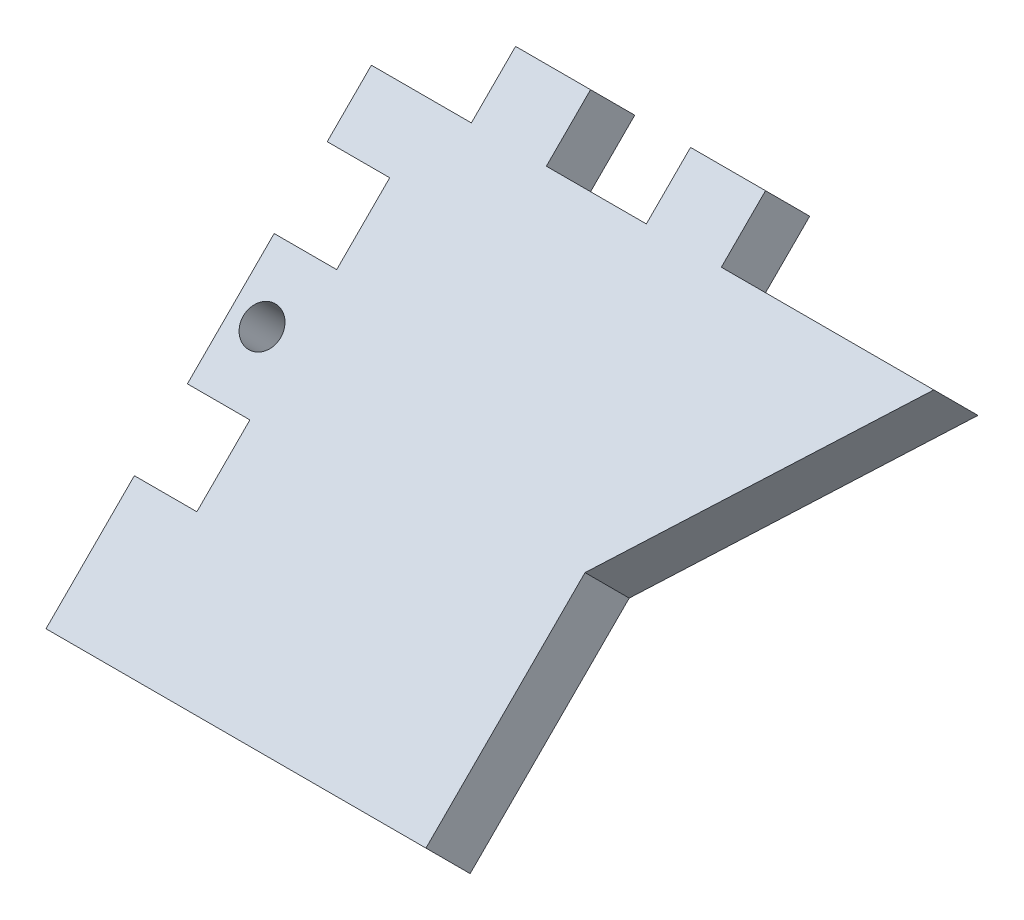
from build123d import *

# Parameters (mm, degrees)
BOSS_EXTRUDE5_DEPTH = 6.35
SKETCH13_R          = 1.905
CUT_EXTRUDE5_DEPTH  = 6.35


with BuildPart() as part:
    # Sketch4 → Boss-Extrude5 (new body)
    with BuildSketch(Plane(origin=(0, 0, 0), x_dir=(1, 0, 0), z_dir=(0, 0.7071067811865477, 0.7071067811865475))):
        Polygon((0, 12.7), (0, 0), (38.608, 0), (38.608, 22.86), (57.15, 46.75886), (35.56, 46.75886), (35.56, 53.10886), (27.94, 53.10886), (27.94, 46.75886), (17.78, 46.75886), (17.78, 53.10886), (10.16, 53.10886), (10.16, 46.75886), (0, 46.75886), (0, 40.4114), (6.35, 40.4114), (6.35, 32.7914), (0, 32.7914), (0, 20.32), (6.35, 20.32), (6.35, 12.7), align=None)
    extrude(amount=BOSS_EXTRUDE5_DEPTH)

    # Sketch13 → Cut-Extrude5 (cut)
    with BuildSketch(Plane(origin=(0, 4.490128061, 4.490128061), x_dir=(1, 0, 0), z_dir=(0, 0.7071067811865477, 0.7071067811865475))):
        with Locations(Location((3.175, 26.5557, 0), (0, 0, 270))):
            Circle(SKETCH13_R)
    extrude(amount=-CUT_EXTRUDE5_DEPTH, mode=Mode.SUBTRACT)


solid = part.part
